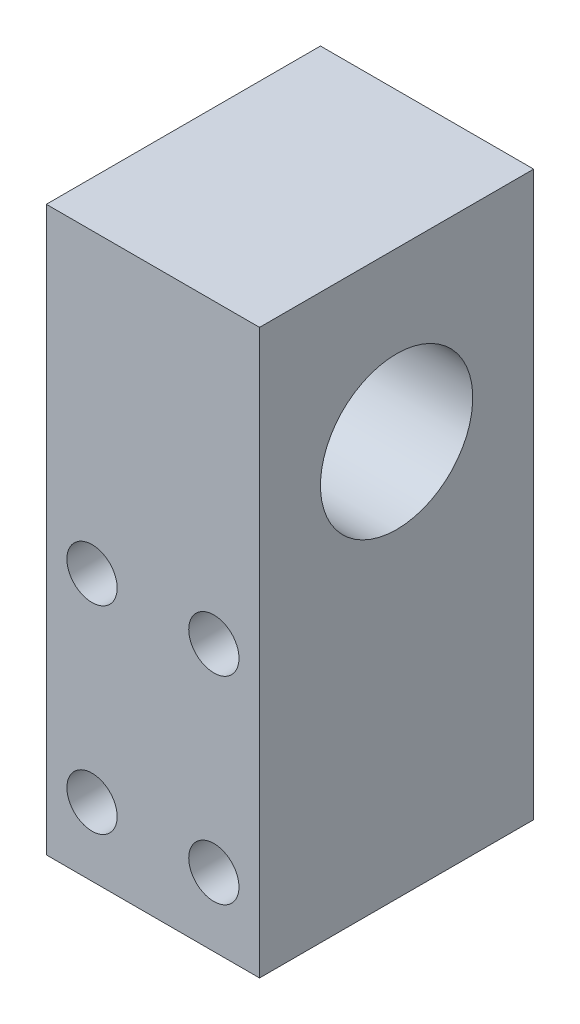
ISO-10303-21;
HEADER;
FILE_DESCRIPTION(('STEP AP214'),'2;1');
FILE_NAME('part.step','',(''),(''),'','','');
FILE_SCHEMA(('AUTOMOTIVE_DESIGN { 1 0 10303 214 1 1 1 1 }'));
ENDSEC;
DATA;
#1=APPLICATION_CONTEXT('core data for automotive mechanical design processes');
#2=APPLICATION_PROTOCOL_DEFINITION('international standard','automotive_design',2000,#1);
#3=PRODUCT_CONTEXT('',#1,'mechanical');
#4=PRODUCT('Part','Part','',(#3));
#5=PRODUCT_RELATED_PRODUCT_CATEGORY('part','',(#4));
#6=PRODUCT_DEFINITION_FORMATION('','',#4);
#7=PRODUCT_DEFINITION_CONTEXT('part definition',#1,'design');
#8=PRODUCT_DEFINITION('design','',#6,#7);
#9=PRODUCT_DEFINITION_SHAPE('','',#8);
#10=(LENGTH_UNIT() NAMED_UNIT(*) SI_UNIT(.MILLI.,.METRE.));
#11=(NAMED_UNIT(*) PLANE_ANGLE_UNIT() SI_UNIT($,.RADIAN.));
#12=(NAMED_UNIT(*) SI_UNIT($,.STERADIAN.) SOLID_ANGLE_UNIT());
#13=UNCERTAINTY_MEASURE_WITH_UNIT(LENGTH_MEASURE(1.E-05),#10,'distance_accuracy_value','');
#14=(GEOMETRIC_REPRESENTATION_CONTEXT(3) GLOBAL_UNCERTAINTY_ASSIGNED_CONTEXT((#13)) GLOBAL_UNIT_ASSIGNED_CONTEXT((#10,
#11,#12)) REPRESENTATION_CONTEXT('',''));
#15=CARTESIAN_POINT('',(0.,0.,0.));
#16=DIRECTION('',(0.,0.,1.));
#17=DIRECTION('',(1.,0.,0.));
#18=AXIS2_PLACEMENT_3D('',#15,#16,#17);
#19=CARTESIAN_POINT('',(7.,18.5,18.));
#20=DIRECTION('',(-1.,0.,0.));
#21=DIRECTION('',(0.,-1.,0.));
#22=AXIS2_PLACEMENT_3D('',#19,#20,#21);
#23=PLANE('',#22);
#24=CARTESIAN_POINT('',(7.,7.5,9.));
#25=DIRECTION('',(1.,0.,0.));
#26=DIRECTION('',(0.,1.,0.));
#27=AXIS2_PLACEMENT_3D('',#24,#25,#26);
#28=CIRCLE('',#27,5.);
#29=CARTESIAN_POINT('',(7.,12.5,9.));
#30=VERTEX_POINT('',#29);
#31=EDGE_CURVE('E117',#30,#30,#28,.T.);
#32=ORIENTED_EDGE('',*,*,#31,.F.);
#33=EDGE_LOOP('',(#32));
#34=FACE_BOUND('',#33,.T.);
#35=DIRECTION('',(0.,1.,0.));
#36=VECTOR('',#35,1.);
#37=CARTESIAN_POINT('',(7.,18.5,0.));
#38=LINE('',#37,#36);
#39=CARTESIAN_POINT('',(7.,-18.5,0.));
#40=VERTEX_POINT('',#39);
#41=CARTESIAN_POINT('',(7.,18.5,0.));
#42=VERTEX_POINT('',#41);
#43=EDGE_CURVE('E104',#40,#42,#38,.T.);
#44=ORIENTED_EDGE('',*,*,#43,.T.);
#45=DIRECTION('',(0.,0.,-1.));
#46=VECTOR('',#45,1.);
#47=CARTESIAN_POINT('',(7.,18.5,18.));
#48=LINE('',#47,#46);
#49=CARTESIAN_POINT('',(7.,18.5,18.));
#50=VERTEX_POINT('',#49);
#51=EDGE_CURVE('E11',#50,#42,#48,.T.);
#52=ORIENTED_EDGE('',*,*,#51,.F.);
#53=DIRECTION('',(0.,1.,0.));
#54=VECTOR('',#53,1.);
#55=CARTESIAN_POINT('',(7.,18.5,18.));
#56=LINE('',#55,#54);
#57=CARTESIAN_POINT('',(7.,-18.5,18.));
#58=VERTEX_POINT('',#57);
#59=EDGE_CURVE('E91',#58,#50,#56,.T.);
#60=ORIENTED_EDGE('',*,*,#59,.F.);
#61=DIRECTION('',(0.,0.,-1.));
#62=VECTOR('',#61,1.);
#63=CARTESIAN_POINT('',(7.,-18.5,18.));
#64=LINE('',#63,#62);
#65=EDGE_CURVE('E100',#58,#40,#64,.T.);
#66=ORIENTED_EDGE('',*,*,#65,.T.);
#67=EDGE_LOOP('',(#44,#52,#60,#66));
#68=FACE_BOUND('',#67,.T.);
#69=ADVANCED_FACE('F39',(#34,#68),#23,.F.);
#70=CARTESIAN_POINT('',(-7.,18.5,18.));
#71=DIRECTION('',(0.,-1.,0.));
#72=DIRECTION('',(0.,0.,-1.));
#73=AXIS2_PLACEMENT_3D('',#70,#71,#72);
#74=PLANE('',#73);
#75=DIRECTION('',(-1.,0.,0.));
#76=VECTOR('',#75,1.);
#77=CARTESIAN_POINT('',(-7.,18.5,0.));
#78=LINE('',#77,#76);
#79=CARTESIAN_POINT('',(-7.,18.5,0.));
#80=VERTEX_POINT('',#79);
#81=EDGE_CURVE('E95',#42,#80,#78,.T.);
#82=ORIENTED_EDGE('',*,*,#81,.T.);
#83=DIRECTION('',(0.,0.,-1.));
#84=VECTOR('',#83,1.);
#85=CARTESIAN_POINT('',(-7.,18.5,18.));
#86=LINE('',#85,#84);
#87=CARTESIAN_POINT('',(-7.,18.5,18.));
#88=VERTEX_POINT('',#87);
#89=EDGE_CURVE('E48',#88,#80,#86,.T.);
#90=ORIENTED_EDGE('',*,*,#89,.F.);
#91=DIRECTION('',(-1.,0.,0.));
#92=VECTOR('',#91,1.);
#93=CARTESIAN_POINT('',(-7.,18.5,18.));
#94=LINE('',#93,#92);
#95=EDGE_CURVE('E86',#50,#88,#94,.T.);
#96=ORIENTED_EDGE('',*,*,#95,.F.);
#97=ORIENTED_EDGE('',*,*,#51,.T.);
#98=EDGE_LOOP('',(#82,#90,#96,#97));
#99=FACE_BOUND('',#98,.T.);
#100=ADVANCED_FACE('F94',(#99),#74,.F.);
#101=CARTESIAN_POINT('',(-7.,18.5,18.));
#102=DIRECTION('',(1.,0.,0.));
#103=DIRECTION('',(0.,1.,0.));
#104=AXIS2_PLACEMENT_3D('',#101,#102,#103);
#105=PLANE('',#104);
#106=CARTESIAN_POINT('',(-7.,7.5,9.));
#107=DIRECTION('',(1.,0.,0.));
#108=DIRECTION('',(0.,1.,0.));
#109=AXIS2_PLACEMENT_3D('',#106,#107,#108);
#110=CIRCLE('',#109,5.);
#111=CARTESIAN_POINT('',(-7.,12.5,9.));
#112=VERTEX_POINT('',#111);
#113=EDGE_CURVE('E42',#112,#112,#110,.T.);
#114=ORIENTED_EDGE('',*,*,#113,.T.);
#115=EDGE_LOOP('',(#114));
#116=FACE_BOUND('',#115,.T.);
#117=DIRECTION('',(0.,-1.,0.));
#118=VECTOR('',#117,1.);
#119=CARTESIAN_POINT('',(-7.,18.5,0.));
#120=LINE('',#119,#118);
#121=CARTESIAN_POINT('',(-7.,-18.5,0.));
#122=VERTEX_POINT('',#121);
#123=EDGE_CURVE('E73',#80,#122,#120,.T.);
#124=ORIENTED_EDGE('',*,*,#123,.T.);
#125=DIRECTION('',(0.,0.,-1.));
#126=VECTOR('',#125,1.);
#127=CARTESIAN_POINT('',(-7.,-18.5,18.));
#128=LINE('',#127,#126);
#129=CARTESIAN_POINT('',(-7.,-18.5,18.));
#130=VERTEX_POINT('',#129);
#131=EDGE_CURVE('E96',#130,#122,#128,.T.);
#132=ORIENTED_EDGE('',*,*,#131,.F.);
#133=DIRECTION('',(0.,-1.,0.));
#134=VECTOR('',#133,1.);
#135=CARTESIAN_POINT('',(-7.,18.5,18.));
#136=LINE('',#135,#134);
#137=EDGE_CURVE('E89',#88,#130,#136,.T.);
#138=ORIENTED_EDGE('',*,*,#137,.F.);
#139=ORIENTED_EDGE('',*,*,#89,.T.);
#140=EDGE_LOOP('',(#124,#132,#138,#139));
#141=FACE_BOUND('',#140,.T.);
#142=ADVANCED_FACE('F98',(#116,#141),#105,.F.);
#143=CARTESIAN_POINT('',(-7.,-18.5,18.));
#144=DIRECTION('',(0.,1.,0.));
#145=DIRECTION('',(0.,0.,1.));
#146=AXIS2_PLACEMENT_3D('',#143,#144,#145);
#147=PLANE('',#146);
#148=DIRECTION('',(1.,0.,0.));
#149=VECTOR('',#148,1.);
#150=CARTESIAN_POINT('',(-7.,-18.5,0.));
#151=LINE('',#150,#149);
#152=EDGE_CURVE('E79',#122,#40,#151,.T.);
#153=ORIENTED_EDGE('',*,*,#152,.T.);
#154=ORIENTED_EDGE('',*,*,#65,.F.);
#155=DIRECTION('',(1.,0.,0.));
#156=VECTOR('',#155,1.);
#157=CARTESIAN_POINT('',(-7.,-18.5,18.));
#158=LINE('',#157,#156);
#159=EDGE_CURVE('E56',#130,#58,#158,.T.);
#160=ORIENTED_EDGE('',*,*,#159,.F.);
#161=ORIENTED_EDGE('',*,*,#131,.T.);
#162=EDGE_LOOP('',(#153,#154,#160,#161));
#163=FACE_BOUND('',#162,.T.);
#164=ADVANCED_FACE('F111',(#163),#147,.F.);
#165=CARTESIAN_POINT('',(0.,0.,18.));
#166=DIRECTION('',(0.,0.,1.));
#167=DIRECTION('',(1.,0.,0.));
#168=AXIS2_PLACEMENT_3D('',#165,#166,#167);
#169=PLANE('',#168);
#170=CARTESIAN_POINT('',(4.,-1.,18.));
#171=DIRECTION('',(0.,0.,-1.));
#172=DIRECTION('',(-1.,0.,0.));
#173=AXIS2_PLACEMENT_3D('',#170,#171,#172);
#174=CIRCLE('',#173,1.65);
#175=CARTESIAN_POINT('',(2.35000000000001,-1.,18.));
#176=VERTEX_POINT('',#175);
#177=EDGE_CURVE('E138',#176,#176,#174,.T.);
#178=ORIENTED_EDGE('',*,*,#177,.T.);
#179=EDGE_LOOP('',(#178));
#180=FACE_BOUND('',#179,.T.);
#181=CARTESIAN_POINT('',(-4.,-1.,18.));
#182=DIRECTION('',(0.,0.,-1.));
#183=DIRECTION('',(-1.,0.,0.));
#184=AXIS2_PLACEMENT_3D('',#181,#182,#183);
#185=CIRCLE('',#184,1.65);
#186=CARTESIAN_POINT('',(-5.65,-1.,18.));
#187=VERTEX_POINT('',#186);
#188=EDGE_CURVE('E132',#187,#187,#185,.T.);
#189=ORIENTED_EDGE('',*,*,#188,.T.);
#190=EDGE_LOOP('',(#189));
#191=FACE_BOUND('',#190,.T.);
#192=CARTESIAN_POINT('',(4.,-14.,18.));
#193=DIRECTION('',(0.,0.,-1.));
#194=DIRECTION('',(-1.,0.,0.));
#195=AXIS2_PLACEMENT_3D('',#192,#193,#194);
#196=CIRCLE('',#195,1.65);
#197=CARTESIAN_POINT('',(2.35,-14.,18.));
#198=VERTEX_POINT('',#197);
#199=EDGE_CURVE('E126',#198,#198,#196,.T.);
#200=ORIENTED_EDGE('',*,*,#199,.T.);
#201=EDGE_LOOP('',(#200));
#202=FACE_BOUND('',#201,.T.);
#203=CARTESIAN_POINT('',(-4.,-14.,18.));
#204=DIRECTION('',(0.,0.,-1.));
#205=DIRECTION('',(-1.,0.,0.));
#206=AXIS2_PLACEMENT_3D('',#203,#204,#205);
#207=CIRCLE('',#206,1.65);
#208=CARTESIAN_POINT('',(-5.65,-14.,18.));
#209=VERTEX_POINT('',#208);
#210=EDGE_CURVE('E120',#209,#209,#207,.T.);
#211=ORIENTED_EDGE('',*,*,#210,.T.);
#212=EDGE_LOOP('',(#211));
#213=FACE_BOUND('',#212,.T.);
#214=ORIENTED_EDGE('',*,*,#59,.T.);
#215=ORIENTED_EDGE('',*,*,#95,.T.);
#216=ORIENTED_EDGE('',*,*,#137,.T.);
#217=ORIENTED_EDGE('',*,*,#159,.T.);
#218=EDGE_LOOP('',(#214,#215,#216,#217));
#219=FACE_BOUND('',#218,.T.);
#220=ADVANCED_FACE('F87',(#180,#191,#202,#213,#219),#169,.T.);
#221=CARTESIAN_POINT('',(0.,0.,0.));
#222=DIRECTION('',(0.,0.,1.));
#223=DIRECTION('',(1.,0.,0.));
#224=AXIS2_PLACEMENT_3D('',#221,#222,#223);
#225=PLANE('',#224);
#226=CARTESIAN_POINT('',(4.,-1.,0.));
#227=DIRECTION('',(0.,0.,-1.));
#228=DIRECTION('',(-1.,0.,0.));
#229=AXIS2_PLACEMENT_3D('',#226,#227,#228);
#230=CIRCLE('',#229,1.65);
#231=CARTESIAN_POINT('',(2.35000000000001,-1.,0.));
#232=VERTEX_POINT('',#231);
#233=EDGE_CURVE('E141',#232,#232,#230,.T.);
#234=ORIENTED_EDGE('',*,*,#233,.F.);
#235=EDGE_LOOP('',(#234));
#236=FACE_BOUND('',#235,.T.);
#237=CARTESIAN_POINT('',(-4.,-1.,0.));
#238=DIRECTION('',(0.,0.,-1.));
#239=DIRECTION('',(-1.,0.,0.));
#240=AXIS2_PLACEMENT_3D('',#237,#238,#239);
#241=CIRCLE('',#240,1.65);
#242=CARTESIAN_POINT('',(-5.65,-1.,0.));
#243=VERTEX_POINT('',#242);
#244=EDGE_CURVE('E135',#243,#243,#241,.T.);
#245=ORIENTED_EDGE('',*,*,#244,.F.);
#246=EDGE_LOOP('',(#245));
#247=FACE_BOUND('',#246,.T.);
#248=CARTESIAN_POINT('',(4.,-14.,0.));
#249=DIRECTION('',(0.,0.,-1.));
#250=DIRECTION('',(-1.,0.,0.));
#251=AXIS2_PLACEMENT_3D('',#248,#249,#250);
#252=CIRCLE('',#251,1.65);
#253=CARTESIAN_POINT('',(2.35,-14.,0.));
#254=VERTEX_POINT('',#253);
#255=EDGE_CURVE('E129',#254,#254,#252,.T.);
#256=ORIENTED_EDGE('',*,*,#255,.F.);
#257=EDGE_LOOP('',(#256));
#258=FACE_BOUND('',#257,.T.);
#259=CARTESIAN_POINT('',(-4.,-14.,0.));
#260=DIRECTION('',(0.,0.,-1.));
#261=DIRECTION('',(-1.,0.,0.));
#262=AXIS2_PLACEMENT_3D('',#259,#260,#261);
#263=CIRCLE('',#262,1.65);
#264=CARTESIAN_POINT('',(-5.65,-14.,0.));
#265=VERTEX_POINT('',#264);
#266=EDGE_CURVE('E123',#265,#265,#263,.T.);
#267=ORIENTED_EDGE('',*,*,#266,.F.);
#268=EDGE_LOOP('',(#267));
#269=FACE_BOUND('',#268,.T.);
#270=ORIENTED_EDGE('',*,*,#43,.F.);
#271=ORIENTED_EDGE('',*,*,#152,.F.);
#272=ORIENTED_EDGE('',*,*,#123,.F.);
#273=ORIENTED_EDGE('',*,*,#81,.F.);
#274=EDGE_LOOP('',(#270,#271,#272,#273));
#275=FACE_BOUND('',#274,.T.);
#276=ADVANCED_FACE('F114',(#236,#247,#258,#269,#275),#225,.F.);
#277=CARTESIAN_POINT('',(-11.,7.49999999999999,9.));
#278=DIRECTION('',(1.,0.,0.));
#279=DIRECTION('',(0.,1.,0.));
#280=AXIS2_PLACEMENT_3D('',#277,#278,#279);
#281=CYLINDRICAL_SURFACE('',#280,5.);
#282=ORIENTED_EDGE('',*,*,#31,.T.);
#283=EDGE_LOOP('',(#282));
#284=FACE_BOUND('',#283,.T.);
#285=ORIENTED_EDGE('',*,*,#113,.F.);
#286=EDGE_LOOP('',(#285));
#287=FACE_BOUND('',#286,.T.);
#288=ADVANCED_FACE('F149',(#284,#287),#281,.F.);
#289=CARTESIAN_POINT('',(-4.,-14.,0.));
#290=DIRECTION('',(0.,0.,-1.));
#291=DIRECTION('',(-1.,0.,0.));
#292=AXIS2_PLACEMENT_3D('',#289,#290,#291);
#293=CYLINDRICAL_SURFACE('',#292,1.65);
#294=ORIENTED_EDGE('',*,*,#210,.F.);
#295=EDGE_LOOP('',(#294));
#296=FACE_BOUND('',#295,.T.);
#297=ORIENTED_EDGE('',*,*,#266,.T.);
#298=EDGE_LOOP('',(#297));
#299=FACE_BOUND('',#298,.T.);
#300=ADVANCED_FACE('F157',(#296,#299),#293,.F.);
#301=CARTESIAN_POINT('',(4.,-14.,0.));
#302=DIRECTION('',(0.,0.,-1.));
#303=DIRECTION('',(-1.,0.,0.));
#304=AXIS2_PLACEMENT_3D('',#301,#302,#303);
#305=CYLINDRICAL_SURFACE('',#304,1.65);
#306=ORIENTED_EDGE('',*,*,#199,.F.);
#307=EDGE_LOOP('',(#306));
#308=FACE_BOUND('',#307,.T.);
#309=ORIENTED_EDGE('',*,*,#255,.T.);
#310=EDGE_LOOP('',(#309));
#311=FACE_BOUND('',#310,.T.);
#312=ADVANCED_FACE('F159',(#308,#311),#305,.F.);
#313=CARTESIAN_POINT('',(-4.,-1.,0.));
#314=DIRECTION('',(0.,0.,-1.));
#315=DIRECTION('',(-1.,0.,0.));
#316=AXIS2_PLACEMENT_3D('',#313,#314,#315);
#317=CYLINDRICAL_SURFACE('',#316,1.65);
#318=ORIENTED_EDGE('',*,*,#188,.F.);
#319=EDGE_LOOP('',(#318));
#320=FACE_BOUND('',#319,.T.);
#321=ORIENTED_EDGE('',*,*,#244,.T.);
#322=EDGE_LOOP('',(#321));
#323=FACE_BOUND('',#322,.T.);
#324=ADVANCED_FACE('F166',(#320,#323),#317,.F.);
#325=CARTESIAN_POINT('',(4.,-1.,0.));
#326=DIRECTION('',(0.,0.,-1.));
#327=DIRECTION('',(-1.,0.,0.));
#328=AXIS2_PLACEMENT_3D('',#325,#326,#327);
#329=CYLINDRICAL_SURFACE('',#328,1.65);
#330=ORIENTED_EDGE('',*,*,#177,.F.);
#331=EDGE_LOOP('',(#330));
#332=FACE_BOUND('',#331,.T.);
#333=ORIENTED_EDGE('',*,*,#233,.T.);
#334=EDGE_LOOP('',(#333));
#335=FACE_BOUND('',#334,.T.);
#336=ADVANCED_FACE('F145',(#332,#335),#329,.F.);
#337=CLOSED_SHELL('',(#69,#100,#142,#164,#220,#276,#288,#300,#312,#324,#336));
#338=MANIFOLD_SOLID_BREP('B2',#337);
#339=ADVANCED_BREP_SHAPE_REPRESENTATION('',(#18,#338),#14);
#340=SHAPE_DEFINITION_REPRESENTATION(#9,#339);
ENDSEC;
END-ISO-10303-21;
